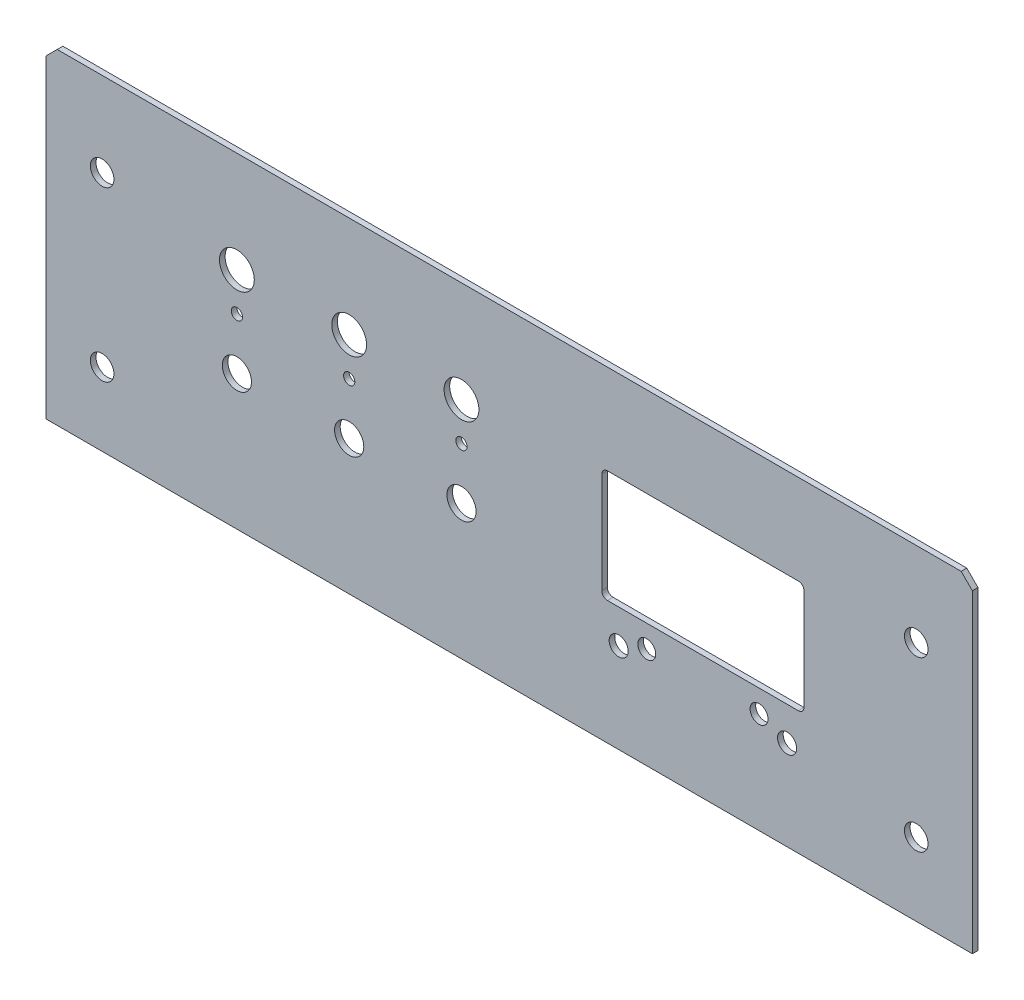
ISO-10303-21;
HEADER;
FILE_DESCRIPTION(('STEP AP214'),'2;1');
FILE_NAME('part.step','',(''),(''),'','','');
FILE_SCHEMA(('AUTOMOTIVE_DESIGN { 1 0 10303 214 1 1 1 1 }'));
ENDSEC;
DATA;
#1=APPLICATION_CONTEXT('core data for automotive mechanical design processes');
#2=APPLICATION_PROTOCOL_DEFINITION('international standard','automotive_design',2000,#1);
#3=PRODUCT_CONTEXT('',#1,'mechanical');
#4=PRODUCT('Part','Part','',(#3));
#5=PRODUCT_RELATED_PRODUCT_CATEGORY('part','',(#4));
#6=PRODUCT_DEFINITION_FORMATION('','',#4);
#7=PRODUCT_DEFINITION_CONTEXT('part definition',#1,'design');
#8=PRODUCT_DEFINITION('design','',#6,#7);
#9=PRODUCT_DEFINITION_SHAPE('','',#8);
#10=(LENGTH_UNIT() NAMED_UNIT(*) SI_UNIT(.MILLI.,.METRE.));
#11=(NAMED_UNIT(*) PLANE_ANGLE_UNIT() SI_UNIT($,.RADIAN.));
#12=(NAMED_UNIT(*) SI_UNIT($,.STERADIAN.) SOLID_ANGLE_UNIT());
#13=UNCERTAINTY_MEASURE_WITH_UNIT(LENGTH_MEASURE(1.E-05),#10,'distance_accuracy_value','');
#14=(GEOMETRIC_REPRESENTATION_CONTEXT(3) GLOBAL_UNCERTAINTY_ASSIGNED_CONTEXT((#13)) GLOBAL_UNIT_ASSIGNED_CONTEXT((#10,
#11,#12)) REPRESENTATION_CONTEXT('',''));
#15=CARTESIAN_POINT('',(0.,0.,0.));
#16=DIRECTION('',(0.,0.,1.));
#17=DIRECTION('',(1.,0.,0.));
#18=AXIS2_PLACEMENT_3D('',#15,#16,#17);
#19=CARTESIAN_POINT('',(82.5,27.,-1.));
#20=DIRECTION('',(1.,0.,0.));
#21=DIRECTION('',(0.,1.,0.));
#22=AXIS2_PLACEMENT_3D('',#19,#20,#21);
#23=PLANE('',#22);
#24=DIRECTION('',(0.,1.,0.));
#25=VECTOR('',#24,1.);
#26=CARTESIAN_POINT('',(82.5,27.,0.));
#27=LINE('',#26,#25);
#28=CARTESIAN_POINT('',(82.5,-29.,0.));
#29=VERTEX_POINT('',#28);
#30=CARTESIAN_POINT('',(82.5,27.,0.));
#31=VERTEX_POINT('',#30);
#32=EDGE_CURVE('E274',#29,#31,#27,.T.);
#33=ORIENTED_EDGE('',*,*,#32,.F.);
#34=DIRECTION('',(0.,0.,1.));
#35=VECTOR('',#34,1.);
#36=CARTESIAN_POINT('',(82.5,-29.,-1.));
#37=LINE('',#36,#35);
#38=CARTESIAN_POINT('',(82.5,-29.,-1.));
#39=VERTEX_POINT('',#38);
#40=EDGE_CURVE('E11',#39,#29,#37,.T.);
#41=ORIENTED_EDGE('',*,*,#40,.F.);
#42=DIRECTION('',(0.,1.,0.));
#43=VECTOR('',#42,1.);
#44=CARTESIAN_POINT('',(82.5,27.,-1.));
#45=LINE('',#44,#43);
#46=CARTESIAN_POINT('',(82.5,27.,-1.));
#47=VERTEX_POINT('',#46);
#48=EDGE_CURVE('E277',#39,#47,#45,.T.);
#49=ORIENTED_EDGE('',*,*,#48,.T.);
#50=DIRECTION('',(0.,0.,1.));
#51=VECTOR('',#50,1.);
#52=CARTESIAN_POINT('',(82.5,27.,-1.));
#53=LINE('',#52,#51);
#54=EDGE_CURVE('E41',#47,#31,#53,.T.);
#55=ORIENTED_EDGE('',*,*,#54,.T.);
#56=EDGE_LOOP('',(#33,#41,#49,#55));
#57=FACE_BOUND('',#56,.T.);
#58=ADVANCED_FACE('F38',(#57),#23,.T.);
#59=CARTESIAN_POINT('',(-82.5,-29.,-1.));
#60=DIRECTION('',(0.,-1.,0.));
#61=DIRECTION('',(0.,0.,-1.));
#62=AXIS2_PLACEMENT_3D('',#59,#60,#61);
#63=PLANE('',#62);
#64=DIRECTION('',(1.,0.,0.));
#65=VECTOR('',#64,1.);
#66=CARTESIAN_POINT('',(-82.5,-29.,0.));
#67=LINE('',#66,#65);
#68=CARTESIAN_POINT('',(-82.5,-29.,0.));
#69=VERTEX_POINT('',#68);
#70=EDGE_CURVE('E281',#69,#29,#67,.T.);
#71=ORIENTED_EDGE('',*,*,#70,.F.);
#72=DIRECTION('',(0.,0.,1.));
#73=VECTOR('',#72,1.);
#74=CARTESIAN_POINT('',(-82.5,-29.,-1.));
#75=LINE('',#74,#73);
#76=CARTESIAN_POINT('',(-82.5,-29.,-1.));
#77=VERTEX_POINT('',#76);
#78=EDGE_CURVE('E46',#77,#69,#75,.T.);
#79=ORIENTED_EDGE('',*,*,#78,.F.);
#80=DIRECTION('',(1.,0.,0.));
#81=VECTOR('',#80,1.);
#82=CARTESIAN_POINT('',(-82.5,-29.,-1.));
#83=LINE('',#82,#81);
#84=EDGE_CURVE('E293',#77,#39,#83,.T.);
#85=ORIENTED_EDGE('',*,*,#84,.T.);
#86=ORIENTED_EDGE('',*,*,#40,.T.);
#87=EDGE_LOOP('',(#71,#79,#85,#86));
#88=FACE_BOUND('',#87,.T.);
#89=ADVANCED_FACE('F330',(#88),#63,.T.);
#90=CARTESIAN_POINT('',(-82.5,27.,-1.));
#91=DIRECTION('',(-1.,0.,0.));
#92=DIRECTION('',(0.,0.,1.));
#93=AXIS2_PLACEMENT_3D('',#90,#91,#92);
#94=PLANE('',#93);
#95=DIRECTION('',(0.,-1.,0.));
#96=VECTOR('',#95,1.);
#97=CARTESIAN_POINT('',(-82.5,27.,0.));
#98=LINE('',#97,#96);
#99=CARTESIAN_POINT('',(-82.5,27.,0.));
#100=VERTEX_POINT('',#99);
#101=EDGE_CURVE('E307',#100,#69,#98,.T.);
#102=ORIENTED_EDGE('',*,*,#101,.F.);
#103=DIRECTION('',(0.,0.,1.));
#104=VECTOR('',#103,1.);
#105=CARTESIAN_POINT('',(-82.5,27.,-1.));
#106=LINE('',#105,#104);
#107=CARTESIAN_POINT('',(-82.5,27.,-1.));
#108=VERTEX_POINT('',#107);
#109=EDGE_CURVE('E313',#108,#100,#106,.T.);
#110=ORIENTED_EDGE('',*,*,#109,.F.);
#111=DIRECTION('',(0.,-1.,0.));
#112=VECTOR('',#111,1.);
#113=CARTESIAN_POINT('',(-82.5,27.,-1.));
#114=LINE('',#113,#112);
#115=EDGE_CURVE('E290',#108,#77,#114,.T.);
#116=ORIENTED_EDGE('',*,*,#115,.T.);
#117=ORIENTED_EDGE('',*,*,#78,.T.);
#118=EDGE_LOOP('',(#102,#110,#116,#117));
#119=FACE_BOUND('',#118,.T.);
#120=ADVANCED_FACE('F342',(#119),#94,.T.);
#121=CARTESIAN_POINT('',(-80.5,29.,-1.));
#122=DIRECTION('',(-0.707106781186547,0.707106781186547,0.));
#123=DIRECTION('',(-0.707106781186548,-0.707106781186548,0.));
#124=AXIS2_PLACEMENT_3D('',#121,#122,#123);
#125=PLANE('',#124);
#126=DIRECTION('',(-0.707106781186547,-0.707106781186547,0.));
#127=VECTOR('',#126,1.);
#128=CARTESIAN_POINT('',(-80.5,29.,0.));
#129=LINE('',#128,#127);
#130=CARTESIAN_POINT('',(-80.5,29.,0.));
#131=VERTEX_POINT('',#130);
#132=EDGE_CURVE('E304',#131,#100,#129,.T.);
#133=ORIENTED_EDGE('',*,*,#132,.F.);
#134=DIRECTION('',(0.,0.,1.));
#135=VECTOR('',#134,1.);
#136=CARTESIAN_POINT('',(-80.5,29.,-1.));
#137=LINE('',#136,#135);
#138=CARTESIAN_POINT('',(-80.5,29.,-1.));
#139=VERTEX_POINT('',#138);
#140=EDGE_CURVE('E315',#139,#131,#137,.T.);
#141=ORIENTED_EDGE('',*,*,#140,.F.);
#142=DIRECTION('',(-0.707106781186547,-0.707106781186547,0.));
#143=VECTOR('',#142,1.);
#144=CARTESIAN_POINT('',(-80.5,29.,-1.));
#145=LINE('',#144,#143);
#146=EDGE_CURVE('E287',#139,#108,#145,.T.);
#147=ORIENTED_EDGE('',*,*,#146,.T.);
#148=ORIENTED_EDGE('',*,*,#109,.T.);
#149=EDGE_LOOP('',(#133,#141,#147,#148));
#150=FACE_BOUND('',#149,.T.);
#151=ADVANCED_FACE('F340',(#150),#125,.T.);
#152=CARTESIAN_POINT('',(-80.5,29.,-1.));
#153=DIRECTION('',(0.,1.,0.));
#154=DIRECTION('',(0.,0.,1.));
#155=AXIS2_PLACEMENT_3D('',#152,#153,#154);
#156=PLANE('',#155);
#157=DIRECTION('',(-1.,0.,0.));
#158=VECTOR('',#157,1.);
#159=CARTESIAN_POINT('',(-80.5,29.,0.));
#160=LINE('',#159,#158);
#161=CARTESIAN_POINT('',(80.5,29.,0.));
#162=VERTEX_POINT('',#161);
#163=EDGE_CURVE('E301',#162,#131,#160,.T.);
#164=ORIENTED_EDGE('',*,*,#163,.F.);
#165=DIRECTION('',(0.,0.,1.));
#166=VECTOR('',#165,1.);
#167=CARTESIAN_POINT('',(80.5,29.,-1.));
#168=LINE('',#167,#166);
#169=CARTESIAN_POINT('',(80.5,29.,-1.));
#170=VERTEX_POINT('',#169);
#171=EDGE_CURVE('E316',#170,#162,#168,.T.);
#172=ORIENTED_EDGE('',*,*,#171,.F.);
#173=DIRECTION('',(-1.,0.,0.));
#174=VECTOR('',#173,1.);
#175=CARTESIAN_POINT('',(-80.5,29.,-1.));
#176=LINE('',#175,#174);
#177=EDGE_CURVE('E284',#170,#139,#176,.T.);
#178=ORIENTED_EDGE('',*,*,#177,.T.);
#179=ORIENTED_EDGE('',*,*,#140,.T.);
#180=EDGE_LOOP('',(#164,#172,#178,#179));
#181=FACE_BOUND('',#180,.T.);
#182=ADVANCED_FACE('F337',(#181),#156,.T.);
#183=CARTESIAN_POINT('',(80.5,29.,-1.));
#184=DIRECTION('',(0.707106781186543,0.707106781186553,0.));
#185=DIRECTION('',(-0.707106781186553,0.707106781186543,0.));
#186=AXIS2_PLACEMENT_3D('',#183,#184,#185);
#187=PLANE('',#186);
#188=DIRECTION('',(-0.707106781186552,0.707106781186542,0.));
#189=VECTOR('',#188,1.);
#190=CARTESIAN_POINT('',(80.5,29.,0.));
#191=LINE('',#190,#189);
#192=EDGE_CURVE('E298',#31,#162,#191,.T.);
#193=ORIENTED_EDGE('',*,*,#192,.F.);
#194=ORIENTED_EDGE('',*,*,#54,.F.);
#195=DIRECTION('',(-0.707106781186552,0.707106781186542,0.));
#196=VECTOR('',#195,1.);
#197=CARTESIAN_POINT('',(80.5,29.,-1.));
#198=LINE('',#197,#196);
#199=EDGE_CURVE('E280',#47,#170,#198,.T.);
#200=ORIENTED_EDGE('',*,*,#199,.T.);
#201=ORIENTED_EDGE('',*,*,#171,.T.);
#202=EDGE_LOOP('',(#193,#194,#200,#201));
#203=FACE_BOUND('',#202,.T.);
#204=ADVANCED_FACE('F324',(#203),#187,.T.);
#205=CARTESIAN_POINT('',(0.,0.,-1.));
#206=DIRECTION('',(0.,0.,1.));
#207=DIRECTION('',(1.,0.,0.));
#208=AXIS2_PLACEMENT_3D('',#205,#206,#207);
#209=PLANE('',#208);
#210=CARTESIAN_POINT('',(-48.5,4.2,-1.));
#211=DIRECTION('',(0.,0.,1.));
#212=DIRECTION('',(1.,0.,0.));
#213=AXIS2_PLACEMENT_3D('',#210,#211,#212);
#214=CIRCLE('',#213,0.999999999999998);
#215=CARTESIAN_POINT('',(-47.5,4.2,-1.));
#216=VERTEX_POINT('',#215);
#217=EDGE_CURVE('E201',#216,#216,#214,.F.);
#218=ORIENTED_EDGE('',*,*,#217,.F.);
#219=EDGE_LOOP('',(#218));
#220=FACE_BOUND('',#219,.T.);
#221=DIRECTION('',(0.,-1.,0.));
#222=VECTOR('',#221,1.);
#223=CARTESIAN_POINT('',(52.5,12.,-1.));
#224=LINE('',#223,#222);
#225=CARTESIAN_POINT('',(52.5,12.,-1.));
#226=VERTEX_POINT('',#225);
#227=CARTESIAN_POINT('',(52.5,-6.,-1.));
#228=VERTEX_POINT('',#227);
#229=EDGE_CURVE('E160',#226,#228,#224,.T.);
#230=ORIENTED_EDGE('',*,*,#229,.F.);
#231=CARTESIAN_POINT('',(51.5,12.,-1.));
#232=DIRECTION('',(0.,0.,1.));
#233=DIRECTION('',(1.,0.,0.));
#234=AXIS2_PLACEMENT_3D('',#231,#232,#233);
#235=CIRCLE('',#234,1.);
#236=CARTESIAN_POINT('',(51.5,13.,-1.));
#237=VERTEX_POINT('',#236);
#238=EDGE_CURVE('E141',#237,#226,#235,.F.);
#239=ORIENTED_EDGE('',*,*,#238,.F.);
#240=DIRECTION('',(1.,0.,0.));
#241=VECTOR('',#240,1.);
#242=CARTESIAN_POINT('',(17.5,13.,-1.));
#243=LINE('',#242,#241);
#244=CARTESIAN_POINT('',(17.5,13.,-1.));
#245=VERTEX_POINT('',#244);
#246=EDGE_CURVE('E150',#245,#237,#243,.T.);
#247=ORIENTED_EDGE('',*,*,#246,.F.);
#248=CARTESIAN_POINT('',(17.5,12.,-1.));
#249=DIRECTION('',(0.,0.,1.));
#250=DIRECTION('',(1.,0.,0.));
#251=AXIS2_PLACEMENT_3D('',#248,#249,#250);
#252=CIRCLE('',#251,1.);
#253=CARTESIAN_POINT('',(16.5,12.,-1.));
#254=VERTEX_POINT('',#253);
#255=EDGE_CURVE('E54',#254,#245,#252,.F.);
#256=ORIENTED_EDGE('',*,*,#255,.F.);
#257=DIRECTION('',(0.,1.,0.));
#258=VECTOR('',#257,1.);
#259=CARTESIAN_POINT('',(16.5,12.,-1.));
#260=LINE('',#259,#258);
#261=CARTESIAN_POINT('',(16.5,-6.,-1.));
#262=VERTEX_POINT('',#261);
#263=EDGE_CURVE('E809',#262,#254,#260,.T.);
#264=ORIENTED_EDGE('',*,*,#263,.F.);
#265=CARTESIAN_POINT('',(17.5,-6.,-1.));
#266=DIRECTION('',(0.,0.,1.));
#267=DIRECTION('',(1.,0.,0.));
#268=AXIS2_PLACEMENT_3D('',#265,#266,#267);
#269=CIRCLE('',#268,1.);
#270=CARTESIAN_POINT('',(17.5,-7.,-1.));
#271=VERTEX_POINT('',#270);
#272=EDGE_CURVE('E812',#271,#262,#269,.F.);
#273=ORIENTED_EDGE('',*,*,#272,.F.);
#274=DIRECTION('',(-1.,0.,0.));
#275=VECTOR('',#274,1.);
#276=CARTESIAN_POINT('',(17.5,-7.,-1.));
#277=LINE('',#276,#275);
#278=CARTESIAN_POINT('',(51.5,-7.,-1.));
#279=VERTEX_POINT('',#278);
#280=EDGE_CURVE('E815',#279,#271,#277,.T.);
#281=ORIENTED_EDGE('',*,*,#280,.F.);
#282=CARTESIAN_POINT('',(51.5,-6.,-1.));
#283=DIRECTION('',(0.,0.,1.));
#284=DIRECTION('',(1.,0.,0.));
#285=AXIS2_PLACEMENT_3D('',#282,#283,#284);
#286=CIRCLE('',#285,0.999999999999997);
#287=EDGE_CURVE('E164',#228,#279,#286,.F.);
#288=ORIENTED_EDGE('',*,*,#287,.F.);
#289=EDGE_LOOP('',(#230,#239,#247,#256,#264,#273,#281,#288));
#290=FACE_BOUND('',#289,.T.);
#291=CARTESIAN_POINT('',(-28.5,4.2,-1.));
#292=DIRECTION('',(0.,0.,1.));
#293=DIRECTION('',(1.,0.,0.));
#294=AXIS2_PLACEMENT_3D('',#291,#292,#293);
#295=CIRCLE('',#294,0.999999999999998);
#296=CARTESIAN_POINT('',(-27.5,4.2,-1.));
#297=VERTEX_POINT('',#296);
#298=EDGE_CURVE('E207',#297,#297,#295,.F.);
#299=ORIENTED_EDGE('',*,*,#298,.F.);
#300=EDGE_LOOP('',(#299));
#301=FACE_BOUND('',#300,.T.);
#302=CARTESIAN_POINT('',(-8.49999999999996,4.2,-1.));
#303=DIRECTION('',(0.,0.,1.));
#304=DIRECTION('',(1.,0.,0.));
#305=AXIS2_PLACEMENT_3D('',#302,#303,#304);
#306=CIRCLE('',#305,0.999999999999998);
#307=CARTESIAN_POINT('',(-7.49999999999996,4.2,-1.));
#308=VERTEX_POINT('',#307);
#309=EDGE_CURVE('E803',#308,#308,#306,.F.);
#310=ORIENTED_EDGE('',*,*,#309,.F.);
#311=EDGE_LOOP('',(#310));
#312=FACE_BOUND('',#311,.T.);
#313=CARTESIAN_POINT('',(-8.49999999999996,-5.,-1.));
#314=DIRECTION('',(0.,0.,1.));
#315=DIRECTION('',(1.,0.,0.));
#316=AXIS2_PLACEMENT_3D('',#313,#314,#315);
#317=CIRCLE('',#316,2.6);
#318=CARTESIAN_POINT('',(-5.89999999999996,-5.,-1.));
#319=VERTEX_POINT('',#318);
#320=EDGE_CURVE('E806',#319,#319,#317,.F.);
#321=ORIENTED_EDGE('',*,*,#320,.F.);
#322=EDGE_LOOP('',(#321));
#323=FACE_BOUND('',#322,.T.);
#324=CARTESIAN_POINT('',(-8.49999999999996,11.,-1.));
#325=DIRECTION('',(0.,0.,1.));
#326=DIRECTION('',(1.,0.,0.));
#327=AXIS2_PLACEMENT_3D('',#324,#325,#326);
#328=CIRCLE('',#327,3.1);
#329=CARTESIAN_POINT('',(-5.39999999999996,11.,-1.));
#330=VERTEX_POINT('',#329);
#331=EDGE_CURVE('E796',#330,#330,#328,.F.);
#332=ORIENTED_EDGE('',*,*,#331,.F.);
#333=EDGE_LOOP('',(#332));
#334=FACE_BOUND('',#333,.T.);
#335=CARTESIAN_POINT('',(49.5,-13.,-1.));
#336=DIRECTION('',(0.,0.,1.));
#337=DIRECTION('',(1.,0.,0.));
#338=AXIS2_PLACEMENT_3D('',#335,#336,#337);
#339=CIRCLE('',#338,1.7);
#340=CARTESIAN_POINT('',(51.2,-13.,-1.));
#341=VERTEX_POINT('',#340);
#342=EDGE_CURVE('E202',#341,#341,#339,.F.);
#343=ORIENTED_EDGE('',*,*,#342,.F.);
#344=EDGE_LOOP('',(#343));
#345=FACE_BOUND('',#344,.T.);
#346=CARTESIAN_POINT('',(-48.5,-5.,-1.));
#347=DIRECTION('',(0.,0.,1.));
#348=DIRECTION('',(1.,0.,0.));
#349=AXIS2_PLACEMENT_3D('',#346,#347,#348);
#350=CIRCLE('',#349,2.6);
#351=CARTESIAN_POINT('',(-45.9,-5.,-1.));
#352=VERTEX_POINT('',#351);
#353=EDGE_CURVE('E232',#352,#352,#350,.F.);
#354=ORIENTED_EDGE('',*,*,#353,.F.);
#355=EDGE_LOOP('',(#354));
#356=FACE_BOUND('',#355,.T.);
#357=CARTESIAN_POINT('',(-28.5,11.,-1.));
#358=DIRECTION('',(0.,0.,1.));
#359=DIRECTION('',(1.,0.,0.));
#360=AXIS2_PLACEMENT_3D('',#357,#358,#359);
#361=CIRCLE('',#360,3.1);
#362=CARTESIAN_POINT('',(-25.4,11.,-1.));
#363=VERTEX_POINT('',#362);
#364=EDGE_CURVE('E233',#363,#363,#361,.F.);
#365=ORIENTED_EDGE('',*,*,#364,.F.);
#366=EDGE_LOOP('',(#365));
#367=FACE_BOUND('',#366,.T.);
#368=CARTESIAN_POINT('',(24.5,-11.,-1.));
#369=DIRECTION('',(0.,0.,1.));
#370=DIRECTION('',(1.,0.,0.));
#371=AXIS2_PLACEMENT_3D('',#368,#369,#370);
#372=CIRCLE('',#371,1.6);
#373=CARTESIAN_POINT('',(26.1,-11.,-1.));
#374=VERTEX_POINT('',#373);
#375=EDGE_CURVE('E240',#374,#374,#372,.F.);
#376=ORIENTED_EDGE('',*,*,#375,.F.);
#377=EDGE_LOOP('',(#376));
#378=FACE_BOUND('',#377,.T.);
#379=CARTESIAN_POINT('',(44.5,-11.,-1.));
#380=DIRECTION('',(0.,0.,1.));
#381=DIRECTION('',(1.,0.,0.));
#382=AXIS2_PLACEMENT_3D('',#379,#380,#381);
#383=CIRCLE('',#382,1.6);
#384=CARTESIAN_POINT('',(46.1,-11.,-1.));
#385=VERTEX_POINT('',#384);
#386=EDGE_CURVE('E214',#385,#385,#383,.F.);
#387=ORIENTED_EDGE('',*,*,#386,.F.);
#388=EDGE_LOOP('',(#387));
#389=FACE_BOUND('',#388,.T.);
#390=CARTESIAN_POINT('',(-28.5,-5.,-1.));
#391=DIRECTION('',(0.,0.,1.));
#392=DIRECTION('',(1.,0.,0.));
#393=AXIS2_PLACEMENT_3D('',#390,#391,#392);
#394=CIRCLE('',#393,2.6);
#395=CARTESIAN_POINT('',(-25.9,-5.,-1.));
#396=VERTEX_POINT('',#395);
#397=EDGE_CURVE('E215',#396,#396,#394,.F.);
#398=ORIENTED_EDGE('',*,*,#397,.F.);
#399=EDGE_LOOP('',(#398));
#400=FACE_BOUND('',#399,.T.);
#401=CARTESIAN_POINT('',(19.5,-13.,-1.));
#402=DIRECTION('',(0.,0.,1.));
#403=DIRECTION('',(1.,0.,0.));
#404=AXIS2_PLACEMENT_3D('',#401,#402,#403);
#405=CIRCLE('',#404,1.7);
#406=CARTESIAN_POINT('',(21.2,-13.,-1.));
#407=VERTEX_POINT('',#406);
#408=EDGE_CURVE('E222',#407,#407,#405,.F.);
#409=ORIENTED_EDGE('',*,*,#408,.F.);
#410=EDGE_LOOP('',(#409));
#411=FACE_BOUND('',#410,.T.);
#412=CARTESIAN_POINT('',(-48.5,11.,-1.));
#413=DIRECTION('',(0.,0.,1.));
#414=DIRECTION('',(1.,0.,0.));
#415=AXIS2_PLACEMENT_3D('',#412,#413,#414);
#416=CIRCLE('',#415,3.1);
#417=CARTESIAN_POINT('',(-45.4,11.,-1.));
#418=VERTEX_POINT('',#417);
#419=EDGE_CURVE('E249',#418,#418,#416,.F.);
#420=ORIENTED_EDGE('',*,*,#419,.F.);
#421=EDGE_LOOP('',(#420));
#422=FACE_BOUND('',#421,.T.);
#423=CARTESIAN_POINT('',(-72.5,14.,-1.));
#424=DIRECTION('',(0.,0.,-1.));
#425=DIRECTION('',(-1.,0.,0.));
#426=AXIS2_PLACEMENT_3D('',#423,#424,#425);
#427=CIRCLE('',#426,2.1);
#428=CARTESIAN_POINT('',(-74.6,14.,-1.));
#429=VERTEX_POINT('',#428);
#430=EDGE_CURVE('E260',#429,#429,#427,.T.);
#431=ORIENTED_EDGE('',*,*,#430,.F.);
#432=EDGE_LOOP('',(#431));
#433=FACE_BOUND('',#432,.T.);
#434=CARTESIAN_POINT('',(72.5,-16.,-1.));
#435=DIRECTION('',(0.,0.,-1.));
#436=DIRECTION('',(-1.,0.,0.));
#437=AXIS2_PLACEMENT_3D('',#434,#435,#436);
#438=CIRCLE('',#437,2.1);
#439=CARTESIAN_POINT('',(70.4,-16.,-1.));
#440=VERTEX_POINT('',#439);
#441=EDGE_CURVE('E253',#440,#440,#438,.T.);
#442=ORIENTED_EDGE('',*,*,#441,.F.);
#443=EDGE_LOOP('',(#442));
#444=FACE_BOUND('',#443,.T.);
#445=CARTESIAN_POINT('',(-72.5,-16.,-1.));
#446=DIRECTION('',(0.,0.,-1.));
#447=DIRECTION('',(-1.,0.,0.));
#448=AXIS2_PLACEMENT_3D('',#445,#446,#447);
#449=CIRCLE('',#448,2.1);
#450=CARTESIAN_POINT('',(-74.6,-16.,-1.));
#451=VERTEX_POINT('',#450);
#452=EDGE_CURVE('E265',#451,#451,#449,.T.);
#453=ORIENTED_EDGE('',*,*,#452,.F.);
#454=EDGE_LOOP('',(#453));
#455=FACE_BOUND('',#454,.T.);
#456=CARTESIAN_POINT('',(72.5,14.,-1.));
#457=DIRECTION('',(0.,0.,-1.));
#458=DIRECTION('',(-1.,0.,0.));
#459=AXIS2_PLACEMENT_3D('',#456,#457,#458);
#460=CIRCLE('',#459,2.1);
#461=CARTESIAN_POINT('',(70.4,14.,-1.));
#462=VERTEX_POINT('',#461);
#463=EDGE_CURVE('E271',#462,#462,#460,.T.);
#464=ORIENTED_EDGE('',*,*,#463,.F.);
#465=EDGE_LOOP('',(#464));
#466=FACE_BOUND('',#465,.T.);
#467=ORIENTED_EDGE('',*,*,#48,.F.);
#468=ORIENTED_EDGE('',*,*,#84,.F.);
#469=ORIENTED_EDGE('',*,*,#115,.F.);
#470=ORIENTED_EDGE('',*,*,#146,.F.);
#471=ORIENTED_EDGE('',*,*,#177,.F.);
#472=ORIENTED_EDGE('',*,*,#199,.F.);
#473=EDGE_LOOP('',(#467,#468,#469,#470,#471,#472));
#474=FACE_BOUND('',#473,.T.);
#475=ADVANCED_FACE('F156',(#220,#290,#301,#312,#323,#334,#345,#356,#367,#378,#389,#400,#411,
#422,#433,#444,#455,#466,#474),#209,.F.);
#476=CARTESIAN_POINT('',(0.,0.,0.));
#477=DIRECTION('',(0.,0.,1.));
#478=DIRECTION('',(1.,0.,0.));
#479=AXIS2_PLACEMENT_3D('',#476,#477,#478);
#480=PLANE('',#479);
#481=CARTESIAN_POINT('',(-48.5,4.2,0.));
#482=DIRECTION('',(0.,0.,1.));
#483=DIRECTION('',(1.,0.,0.));
#484=AXIS2_PLACEMENT_3D('',#481,#482,#483);
#485=CIRCLE('',#484,0.999999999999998);
#486=CARTESIAN_POINT('',(-47.5,4.2,0.));
#487=VERTEX_POINT('',#486);
#488=EDGE_CURVE('E198',#487,#487,#485,.T.);
#489=ORIENTED_EDGE('',*,*,#488,.F.);
#490=EDGE_LOOP('',(#489));
#491=FACE_BOUND('',#490,.T.);
#492=CARTESIAN_POINT('',(51.5,12.,0.));
#493=DIRECTION('',(0.,0.,1.));
#494=DIRECTION('',(-1.,0.,0.));
#495=AXIS2_PLACEMENT_3D('',#492,#493,#494);
#496=CIRCLE('',#495,1.);
#497=CARTESIAN_POINT('',(52.5,12.,0.));
#498=VERTEX_POINT('',#497);
#499=CARTESIAN_POINT('',(51.5,13.,0.));
#500=VERTEX_POINT('',#499);
#501=EDGE_CURVE('E62',#498,#500,#496,.T.);
#502=ORIENTED_EDGE('',*,*,#501,.F.);
#503=DIRECTION('',(0.,1.,0.));
#504=VECTOR('',#503,1.);
#505=CARTESIAN_POINT('',(52.5,12.,0.));
#506=LINE('',#505,#504);
#507=CARTESIAN_POINT('',(52.5,-6.,0.));
#508=VERTEX_POINT('',#507);
#509=EDGE_CURVE('E147',#508,#498,#506,.T.);
#510=ORIENTED_EDGE('',*,*,#509,.F.);
#511=CARTESIAN_POINT('',(51.5,-6.,0.));
#512=DIRECTION('',(0.,0.,1.));
#513=DIRECTION('',(-1.,0.,0.));
#514=AXIS2_PLACEMENT_3D('',#511,#512,#513);
#515=CIRCLE('',#514,0.999999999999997);
#516=CARTESIAN_POINT('',(51.5,-7.,0.));
#517=VERTEX_POINT('',#516);
#518=EDGE_CURVE('E181',#517,#508,#515,.T.);
#519=ORIENTED_EDGE('',*,*,#518,.F.);
#520=DIRECTION('',(1.,0.,0.));
#521=VECTOR('',#520,1.);
#522=CARTESIAN_POINT('',(17.5,-7.,0.));
#523=LINE('',#522,#521);
#524=CARTESIAN_POINT('',(17.5,-7.,0.));
#525=VERTEX_POINT('',#524);
#526=EDGE_CURVE('E178',#525,#517,#523,.T.);
#527=ORIENTED_EDGE('',*,*,#526,.F.);
#528=CARTESIAN_POINT('',(17.5,-6.,0.));
#529=DIRECTION('',(0.,0.,1.));
#530=DIRECTION('',(-1.,0.,0.));
#531=AXIS2_PLACEMENT_3D('',#528,#529,#530);
#532=CIRCLE('',#531,1.);
#533=CARTESIAN_POINT('',(16.5,-6.,0.));
#534=VERTEX_POINT('',#533);
#535=EDGE_CURVE('E175',#534,#525,#532,.T.);
#536=ORIENTED_EDGE('',*,*,#535,.F.);
#537=DIRECTION('',(0.,-1.,0.));
#538=VECTOR('',#537,1.);
#539=CARTESIAN_POINT('',(16.5,12.,0.));
#540=LINE('',#539,#538);
#541=CARTESIAN_POINT('',(16.5,12.,0.));
#542=VERTEX_POINT('',#541);
#543=EDGE_CURVE('E172',#542,#534,#540,.T.);
#544=ORIENTED_EDGE('',*,*,#543,.F.);
#545=CARTESIAN_POINT('',(17.5,12.,0.));
#546=DIRECTION('',(0.,0.,1.));
#547=DIRECTION('',(-1.,0.,0.));
#548=AXIS2_PLACEMENT_3D('',#545,#546,#547);
#549=CIRCLE('',#548,1.);
#550=CARTESIAN_POINT('',(17.5,13.,0.));
#551=VERTEX_POINT('',#550);
#552=EDGE_CURVE('E169',#551,#542,#549,.T.);
#553=ORIENTED_EDGE('',*,*,#552,.F.);
#554=DIRECTION('',(-1.,0.,0.));
#555=VECTOR('',#554,1.);
#556=CARTESIAN_POINT('',(17.5,13.,0.));
#557=LINE('',#556,#555);
#558=EDGE_CURVE('E162',#500,#551,#557,.T.);
#559=ORIENTED_EDGE('',*,*,#558,.F.);
#560=EDGE_LOOP('',(#502,#510,#519,#527,#536,#544,#553,#559));
#561=FACE_BOUND('',#560,.T.);
#562=CARTESIAN_POINT('',(-28.5,4.2,0.));
#563=DIRECTION('',(0.,0.,1.));
#564=DIRECTION('',(1.,0.,0.));
#565=AXIS2_PLACEMENT_3D('',#562,#563,#564);
#566=CIRCLE('',#565,0.999999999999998);
#567=CARTESIAN_POINT('',(-27.5,4.2,0.));
#568=VERTEX_POINT('',#567);
#569=EDGE_CURVE('E153',#568,#568,#566,.T.);
#570=ORIENTED_EDGE('',*,*,#569,.F.);
#571=EDGE_LOOP('',(#570));
#572=FACE_BOUND('',#571,.T.);
#573=CARTESIAN_POINT('',(-8.49999999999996,4.2,0.));
#574=DIRECTION('',(0.,0.,1.));
#575=DIRECTION('',(1.,0.,0.));
#576=AXIS2_PLACEMENT_3D('',#573,#574,#575);
#577=CIRCLE('',#576,0.999999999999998);
#578=CARTESIAN_POINT('',(-7.49999999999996,4.2,0.));
#579=VERTEX_POINT('',#578);
#580=EDGE_CURVE('E729',#579,#579,#577,.T.);
#581=ORIENTED_EDGE('',*,*,#580,.F.);
#582=EDGE_LOOP('',(#581));
#583=FACE_BOUND('',#582,.T.);
#584=CARTESIAN_POINT('',(-8.49999999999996,-5.,0.));
#585=DIRECTION('',(0.,0.,1.));
#586=DIRECTION('',(1.,0.,0.));
#587=AXIS2_PLACEMENT_3D('',#584,#585,#586);
#588=CIRCLE('',#587,2.6);
#589=CARTESIAN_POINT('',(-5.89999999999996,-5.,0.));
#590=VERTEX_POINT('',#589);
#591=EDGE_CURVE('E733',#590,#590,#588,.T.);
#592=ORIENTED_EDGE('',*,*,#591,.F.);
#593=EDGE_LOOP('',(#592));
#594=FACE_BOUND('',#593,.T.);
#595=CARTESIAN_POINT('',(-8.49999999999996,11.,0.));
#596=DIRECTION('',(0.,0.,1.));
#597=DIRECTION('',(1.,0.,0.));
#598=AXIS2_PLACEMENT_3D('',#595,#596,#597);
#599=CIRCLE('',#598,3.1);
#600=CARTESIAN_POINT('',(-5.39999999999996,11.,0.));
#601=VERTEX_POINT('',#600);
#602=EDGE_CURVE('E737',#601,#601,#599,.T.);
#603=ORIENTED_EDGE('',*,*,#602,.F.);
#604=EDGE_LOOP('',(#603));
#605=FACE_BOUND('',#604,.T.);
#606=CARTESIAN_POINT('',(49.5,-13.,0.));
#607=DIRECTION('',(0.,0.,1.));
#608=DIRECTION('',(1.,0.,0.));
#609=AXIS2_PLACEMENT_3D('',#606,#607,#608);
#610=CIRCLE('',#609,1.7);
#611=CARTESIAN_POINT('',(51.2,-13.,0.));
#612=VERTEX_POINT('',#611);
#613=EDGE_CURVE('E741',#612,#612,#610,.T.);
#614=ORIENTED_EDGE('',*,*,#613,.F.);
#615=EDGE_LOOP('',(#614));
#616=FACE_BOUND('',#615,.T.);
#617=CARTESIAN_POINT('',(-48.5,-5.,0.));
#618=DIRECTION('',(0.,0.,1.));
#619=DIRECTION('',(1.,0.,0.));
#620=AXIS2_PLACEMENT_3D('',#617,#618,#619);
#621=CIRCLE('',#620,2.6);
#622=CARTESIAN_POINT('',(-45.9,-5.,0.));
#623=VERTEX_POINT('',#622);
#624=EDGE_CURVE('E229',#623,#623,#621,.T.);
#625=ORIENTED_EDGE('',*,*,#624,.F.);
#626=EDGE_LOOP('',(#625));
#627=FACE_BOUND('',#626,.T.);
#628=CARTESIAN_POINT('',(-28.5,11.,0.));
#629=DIRECTION('',(0.,0.,1.));
#630=DIRECTION('',(1.,0.,0.));
#631=AXIS2_PLACEMENT_3D('',#628,#629,#630);
#632=CIRCLE('',#631,3.1);
#633=CARTESIAN_POINT('',(-25.4,11.,0.));
#634=VERTEX_POINT('',#633);
#635=EDGE_CURVE('E237',#634,#634,#632,.T.);
#636=ORIENTED_EDGE('',*,*,#635,.F.);
#637=EDGE_LOOP('',(#636));
#638=FACE_BOUND('',#637,.T.);
#639=CARTESIAN_POINT('',(24.5,-11.,0.));
#640=DIRECTION('',(0.,0.,1.));
#641=DIRECTION('',(1.,0.,0.));
#642=AXIS2_PLACEMENT_3D('',#639,#640,#641);
#643=CIRCLE('',#642,1.6);
#644=CARTESIAN_POINT('',(26.1,-11.,0.));
#645=VERTEX_POINT('',#644);
#646=EDGE_CURVE('E218',#645,#645,#643,.T.);
#647=ORIENTED_EDGE('',*,*,#646,.F.);
#648=EDGE_LOOP('',(#647));
#649=FACE_BOUND('',#648,.T.);
#650=CARTESIAN_POINT('',(44.5,-11.,0.));
#651=DIRECTION('',(0.,0.,1.));
#652=DIRECTION('',(1.,0.,0.));
#653=AXIS2_PLACEMENT_3D('',#650,#651,#652);
#654=CIRCLE('',#653,1.6);
#655=CARTESIAN_POINT('',(46.1,-11.,0.));
#656=VERTEX_POINT('',#655);
#657=EDGE_CURVE('E211',#656,#656,#654,.T.);
#658=ORIENTED_EDGE('',*,*,#657,.F.);
#659=EDGE_LOOP('',(#658));
#660=FACE_BOUND('',#659,.T.);
#661=CARTESIAN_POINT('',(-28.5,-5.,0.));
#662=DIRECTION('',(0.,0.,1.));
#663=DIRECTION('',(1.,0.,0.));
#664=AXIS2_PLACEMENT_3D('',#661,#662,#663);
#665=CIRCLE('',#664,2.6);
#666=CARTESIAN_POINT('',(-25.9,-5.,0.));
#667=VERTEX_POINT('',#666);
#668=EDGE_CURVE('E219',#667,#667,#665,.T.);
#669=ORIENTED_EDGE('',*,*,#668,.F.);
#670=EDGE_LOOP('',(#669));
#671=FACE_BOUND('',#670,.T.);
#672=CARTESIAN_POINT('',(19.5,-13.,0.));
#673=DIRECTION('',(0.,0.,1.));
#674=DIRECTION('',(1.,0.,0.));
#675=AXIS2_PLACEMENT_3D('',#672,#673,#674);
#676=CIRCLE('',#675,1.7);
#677=CARTESIAN_POINT('',(21.2,-13.,0.));
#678=VERTEX_POINT('',#677);
#679=EDGE_CURVE('E210',#678,#678,#676,.T.);
#680=ORIENTED_EDGE('',*,*,#679,.F.);
#681=EDGE_LOOP('',(#680));
#682=FACE_BOUND('',#681,.T.);
#683=CARTESIAN_POINT('',(-48.5,11.,0.));
#684=DIRECTION('',(0.,0.,1.));
#685=DIRECTION('',(1.,0.,0.));
#686=AXIS2_PLACEMENT_3D('',#683,#684,#685);
#687=CIRCLE('',#686,3.1);
#688=CARTESIAN_POINT('',(-45.4,11.,0.));
#689=VERTEX_POINT('',#688);
#690=EDGE_CURVE('E236',#689,#689,#687,.T.);
#691=ORIENTED_EDGE('',*,*,#690,.F.);
#692=EDGE_LOOP('',(#691));
#693=FACE_BOUND('',#692,.T.);
#694=CARTESIAN_POINT('',(-72.5,14.,0.));
#695=DIRECTION('',(0.,0.,1.));
#696=DIRECTION('',(1.,0.,0.));
#697=AXIS2_PLACEMENT_3D('',#694,#695,#696);
#698=CIRCLE('',#697,2.1);
#699=CARTESIAN_POINT('',(-70.4,14.,0.));
#700=VERTEX_POINT('',#699);
#701=EDGE_CURVE('E252',#700,#700,#698,.F.);
#702=ORIENTED_EDGE('',*,*,#701,.T.);
#703=EDGE_LOOP('',(#702));
#704=FACE_BOUND('',#703,.T.);
#705=CARTESIAN_POINT('',(72.5,-16.,0.));
#706=DIRECTION('',(0.,0.,1.));
#707=DIRECTION('',(1.,0.,0.));
#708=AXIS2_PLACEMENT_3D('',#705,#706,#707);
#709=CIRCLE('',#708,2.1);
#710=CARTESIAN_POINT('',(74.6,-16.,0.));
#711=VERTEX_POINT('',#710);
#712=EDGE_CURVE('E257',#711,#711,#709,.F.);
#713=ORIENTED_EDGE('',*,*,#712,.T.);
#714=EDGE_LOOP('',(#713));
#715=FACE_BOUND('',#714,.T.);
#716=CARTESIAN_POINT('',(-72.5,-16.,0.));
#717=DIRECTION('',(0.,0.,1.));
#718=DIRECTION('',(1.,0.,0.));
#719=AXIS2_PLACEMENT_3D('',#716,#717,#718);
#720=CIRCLE('',#719,2.1);
#721=CARTESIAN_POINT('',(-70.4,-16.,0.));
#722=VERTEX_POINT('',#721);
#723=EDGE_CURVE('E256',#722,#722,#720,.F.);
#724=ORIENTED_EDGE('',*,*,#723,.T.);
#725=EDGE_LOOP('',(#724));
#726=FACE_BOUND('',#725,.T.);
#727=CARTESIAN_POINT('',(72.5,14.,0.));
#728=DIRECTION('',(0.,0.,1.));
#729=DIRECTION('',(1.,0.,0.));
#730=AXIS2_PLACEMENT_3D('',#727,#728,#729);
#731=CIRCLE('',#730,2.1);
#732=CARTESIAN_POINT('',(74.6,14.,0.));
#733=VERTEX_POINT('',#732);
#734=EDGE_CURVE('E268',#733,#733,#731,.F.);
#735=ORIENTED_EDGE('',*,*,#734,.T.);
#736=EDGE_LOOP('',(#735));
#737=FACE_BOUND('',#736,.T.);
#738=ORIENTED_EDGE('',*,*,#32,.T.);
#739=ORIENTED_EDGE('',*,*,#192,.T.);
#740=ORIENTED_EDGE('',*,*,#163,.T.);
#741=ORIENTED_EDGE('',*,*,#132,.T.);
#742=ORIENTED_EDGE('',*,*,#101,.T.);
#743=ORIENTED_EDGE('',*,*,#70,.T.);
#744=EDGE_LOOP('',(#738,#739,#740,#741,#742,#743));
#745=FACE_BOUND('',#744,.T.);
#746=ADVANCED_FACE('F326',(#491,#561,#572,#583,#594,#605,#616,#627,#638,#649,#660,#671,#682,
#693,#704,#715,#726,#737,#745),#480,.T.);
#747=CARTESIAN_POINT('',(72.5,14.,0.000999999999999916));
#748=DIRECTION('',(0.,0.,-1.));
#749=DIRECTION('',(-1.,0.,0.));
#750=AXIS2_PLACEMENT_3D('',#747,#748,#749);
#751=CYLINDRICAL_SURFACE('',#750,2.1);
#752=ORIENTED_EDGE('',*,*,#734,.F.);
#753=EDGE_LOOP('',(#752));
#754=FACE_BOUND('',#753,.T.);
#755=ORIENTED_EDGE('',*,*,#463,.T.);
#756=EDGE_LOOP('',(#755));
#757=FACE_BOUND('',#756,.T.);
#758=ADVANCED_FACE('F395',(#754,#757),#751,.F.);
#759=CARTESIAN_POINT('',(-72.5,-16.,0.000999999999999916));
#760=DIRECTION('',(0.,0.,-1.));
#761=DIRECTION('',(-1.,0.,0.));
#762=AXIS2_PLACEMENT_3D('',#759,#760,#761);
#763=CYLINDRICAL_SURFACE('',#762,2.1);
#764=ORIENTED_EDGE('',*,*,#723,.F.);
#765=EDGE_LOOP('',(#764));
#766=FACE_BOUND('',#765,.T.);
#767=ORIENTED_EDGE('',*,*,#452,.T.);
#768=EDGE_LOOP('',(#767));
#769=FACE_BOUND('',#768,.T.);
#770=ADVANCED_FACE('F400',(#766,#769),#763,.F.);
#771=CARTESIAN_POINT('',(72.5,-16.,0.000999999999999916));
#772=DIRECTION('',(0.,0.,-1.));
#773=DIRECTION('',(-1.,0.,0.));
#774=AXIS2_PLACEMENT_3D('',#771,#772,#773);
#775=CYLINDRICAL_SURFACE('',#774,2.1);
#776=ORIENTED_EDGE('',*,*,#712,.F.);
#777=EDGE_LOOP('',(#776));
#778=FACE_BOUND('',#777,.T.);
#779=ORIENTED_EDGE('',*,*,#441,.T.);
#780=EDGE_LOOP('',(#779));
#781=FACE_BOUND('',#780,.T.);
#782=ADVANCED_FACE('F413',(#778,#781),#775,.F.);
#783=CARTESIAN_POINT('',(-72.5,14.,0.000999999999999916));
#784=DIRECTION('',(0.,0.,-1.));
#785=DIRECTION('',(-1.,0.,0.));
#786=AXIS2_PLACEMENT_3D('',#783,#784,#785);
#787=CYLINDRICAL_SURFACE('',#786,2.1);
#788=ORIENTED_EDGE('',*,*,#701,.F.);
#789=EDGE_LOOP('',(#788));
#790=FACE_BOUND('',#789,.T.);
#791=ORIENTED_EDGE('',*,*,#430,.T.);
#792=EDGE_LOOP('',(#791));
#793=FACE_BOUND('',#792,.T.);
#794=ADVANCED_FACE('F424',(#790,#793),#787,.F.);
#795=CARTESIAN_POINT('',(-48.5,11.,-1.001));
#796=DIRECTION('',(0.,0.,1.));
#797=DIRECTION('',(1.,0.,0.));
#798=AXIS2_PLACEMENT_3D('',#795,#796,#797);
#799=CYLINDRICAL_SURFACE('',#798,3.1);
#800=ORIENTED_EDGE('',*,*,#690,.T.);
#801=EDGE_LOOP('',(#800));
#802=FACE_BOUND('',#801,.T.);
#803=ORIENTED_EDGE('',*,*,#419,.T.);
#804=EDGE_LOOP('',(#803));
#805=FACE_BOUND('',#804,.T.);
#806=ADVANCED_FACE('F435',(#802,#805),#799,.F.);
#807=CARTESIAN_POINT('',(19.5,-13.,-1.001));
#808=DIRECTION('',(0.,0.,1.));
#809=DIRECTION('',(1.,0.,0.));
#810=AXIS2_PLACEMENT_3D('',#807,#808,#809);
#811=CYLINDRICAL_SURFACE('',#810,1.7);
#812=ORIENTED_EDGE('',*,*,#679,.T.);
#813=EDGE_LOOP('',(#812));
#814=FACE_BOUND('',#813,.T.);
#815=ORIENTED_EDGE('',*,*,#408,.T.);
#816=EDGE_LOOP('',(#815));
#817=FACE_BOUND('',#816,.T.);
#818=ADVANCED_FACE('F462',(#814,#817),#811,.F.);
#819=CARTESIAN_POINT('',(-28.5,-5.,-1.001));
#820=DIRECTION('',(0.,0.,1.));
#821=DIRECTION('',(1.,0.,0.));
#822=AXIS2_PLACEMENT_3D('',#819,#820,#821);
#823=CYLINDRICAL_SURFACE('',#822,2.6);
#824=ORIENTED_EDGE('',*,*,#668,.T.);
#825=EDGE_LOOP('',(#824));
#826=FACE_BOUND('',#825,.T.);
#827=ORIENTED_EDGE('',*,*,#397,.T.);
#828=EDGE_LOOP('',(#827));
#829=FACE_BOUND('',#828,.T.);
#830=ADVANCED_FACE('F473',(#826,#829),#823,.F.);
#831=CARTESIAN_POINT('',(44.5,-11.,-1.001));
#832=DIRECTION('',(0.,0.,1.));
#833=DIRECTION('',(1.,0.,0.));
#834=AXIS2_PLACEMENT_3D('',#831,#832,#833);
#835=CYLINDRICAL_SURFACE('',#834,1.6);
#836=ORIENTED_EDGE('',*,*,#657,.T.);
#837=EDGE_LOOP('',(#836));
#838=FACE_BOUND('',#837,.T.);
#839=ORIENTED_EDGE('',*,*,#386,.T.);
#840=EDGE_LOOP('',(#839));
#841=FACE_BOUND('',#840,.T.);
#842=ADVANCED_FACE('F484',(#838,#841),#835,.F.);
#843=CARTESIAN_POINT('',(24.5,-11.,-1.001));
#844=DIRECTION('',(0.,0.,1.));
#845=DIRECTION('',(1.,0.,0.));
#846=AXIS2_PLACEMENT_3D('',#843,#844,#845);
#847=CYLINDRICAL_SURFACE('',#846,1.6);
#848=ORIENTED_EDGE('',*,*,#646,.T.);
#849=EDGE_LOOP('',(#848));
#850=FACE_BOUND('',#849,.T.);
#851=ORIENTED_EDGE('',*,*,#375,.T.);
#852=EDGE_LOOP('',(#851));
#853=FACE_BOUND('',#852,.T.);
#854=ADVANCED_FACE('F495',(#850,#853),#847,.F.);
#855=CARTESIAN_POINT('',(-28.5,11.,-1.001));
#856=DIRECTION('',(0.,0.,1.));
#857=DIRECTION('',(1.,0.,0.));
#858=AXIS2_PLACEMENT_3D('',#855,#856,#857);
#859=CYLINDRICAL_SURFACE('',#858,3.1);
#860=ORIENTED_EDGE('',*,*,#635,.T.);
#861=EDGE_LOOP('',(#860));
#862=FACE_BOUND('',#861,.T.);
#863=ORIENTED_EDGE('',*,*,#364,.T.);
#864=EDGE_LOOP('',(#863));
#865=FACE_BOUND('',#864,.T.);
#866=ADVANCED_FACE('F506',(#862,#865),#859,.F.);
#867=CARTESIAN_POINT('',(-48.5,-5.,-1.001));
#868=DIRECTION('',(0.,0.,1.));
#869=DIRECTION('',(1.,0.,0.));
#870=AXIS2_PLACEMENT_3D('',#867,#868,#869);
#871=CYLINDRICAL_SURFACE('',#870,2.6);
#872=ORIENTED_EDGE('',*,*,#624,.T.);
#873=EDGE_LOOP('',(#872));
#874=FACE_BOUND('',#873,.T.);
#875=ORIENTED_EDGE('',*,*,#353,.T.);
#876=EDGE_LOOP('',(#875));
#877=FACE_BOUND('',#876,.T.);
#878=ADVANCED_FACE('F517',(#874,#877),#871,.F.);
#879=CARTESIAN_POINT('',(49.5,-13.,-1.001));
#880=DIRECTION('',(0.,0.,1.));
#881=DIRECTION('',(1.,0.,0.));
#882=AXIS2_PLACEMENT_3D('',#879,#880,#881);
#883=CYLINDRICAL_SURFACE('',#882,1.7);
#884=ORIENTED_EDGE('',*,*,#613,.T.);
#885=EDGE_LOOP('',(#884));
#886=FACE_BOUND('',#885,.T.);
#887=ORIENTED_EDGE('',*,*,#342,.T.);
#888=EDGE_LOOP('',(#887));
#889=FACE_BOUND('',#888,.T.);
#890=ADVANCED_FACE('F528',(#886,#889),#883,.F.);
#891=CARTESIAN_POINT('',(-8.49999999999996,11.,-1.001));
#892=DIRECTION('',(0.,0.,1.));
#893=DIRECTION('',(1.,0.,0.));
#894=AXIS2_PLACEMENT_3D('',#891,#892,#893);
#895=CYLINDRICAL_SURFACE('',#894,3.1);
#896=ORIENTED_EDGE('',*,*,#602,.T.);
#897=EDGE_LOOP('',(#896));
#898=FACE_BOUND('',#897,.T.);
#899=ORIENTED_EDGE('',*,*,#331,.T.);
#900=EDGE_LOOP('',(#899));
#901=FACE_BOUND('',#900,.T.);
#902=ADVANCED_FACE('F539',(#898,#901),#895,.F.);
#903=CARTESIAN_POINT('',(-8.49999999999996,-5.,-1.001));
#904=DIRECTION('',(0.,0.,1.));
#905=DIRECTION('',(1.,0.,0.));
#906=AXIS2_PLACEMENT_3D('',#903,#904,#905);
#907=CYLINDRICAL_SURFACE('',#906,2.6);
#908=ORIENTED_EDGE('',*,*,#591,.T.);
#909=EDGE_LOOP('',(#908));
#910=FACE_BOUND('',#909,.T.);
#911=ORIENTED_EDGE('',*,*,#320,.T.);
#912=EDGE_LOOP('',(#911));
#913=FACE_BOUND('',#912,.T.);
#914=ADVANCED_FACE('F550',(#910,#913),#907,.F.);
#915=CARTESIAN_POINT('',(-8.49999999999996,4.2,-1.001));
#916=DIRECTION('',(0.,0.,1.));
#917=DIRECTION('',(1.,0.,0.));
#918=AXIS2_PLACEMENT_3D('',#915,#916,#917);
#919=CYLINDRICAL_SURFACE('',#918,0.999999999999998);
#920=ORIENTED_EDGE('',*,*,#580,.T.);
#921=EDGE_LOOP('',(#920));
#922=FACE_BOUND('',#921,.T.);
#923=ORIENTED_EDGE('',*,*,#309,.T.);
#924=EDGE_LOOP('',(#923));
#925=FACE_BOUND('',#924,.T.);
#926=ADVANCED_FACE('F561',(#922,#925),#919,.F.);
#927=CARTESIAN_POINT('',(-28.5,4.2,-1.001));
#928=DIRECTION('',(0.,0.,1.));
#929=DIRECTION('',(1.,0.,0.));
#930=AXIS2_PLACEMENT_3D('',#927,#928,#929);
#931=CYLINDRICAL_SURFACE('',#930,0.999999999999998);
#932=ORIENTED_EDGE('',*,*,#569,.T.);
#933=EDGE_LOOP('',(#932));
#934=FACE_BOUND('',#933,.T.);
#935=ORIENTED_EDGE('',*,*,#298,.T.);
#936=EDGE_LOOP('',(#935));
#937=FACE_BOUND('',#936,.T.);
#938=ADVANCED_FACE('F572',(#934,#937),#931,.F.);
#939=CARTESIAN_POINT('',(51.5,12.,-1.001));
#940=DIRECTION('',(0.,0.,1.));
#941=DIRECTION('',(1.,0.,0.));
#942=AXIS2_PLACEMENT_3D('',#939,#940,#941);
#943=CYLINDRICAL_SURFACE('',#942,1.);
#944=ORIENTED_EDGE('',*,*,#238,.T.);
#945=DIRECTION('',(0.,0.,1.));
#946=VECTOR('',#945,1.);
#947=CARTESIAN_POINT('',(52.5,12.,-1.001));
#948=LINE('',#947,#946);
#949=EDGE_CURVE('E154',#226,#498,#948,.T.);
#950=ORIENTED_EDGE('',*,*,#949,.T.);
#951=ORIENTED_EDGE('',*,*,#501,.T.);
#952=DIRECTION('',(0.,0.,1.));
#953=VECTOR('',#952,1.);
#954=CARTESIAN_POINT('',(51.5,13.,-1.001));
#955=LINE('',#954,#953);
#956=EDGE_CURVE('E137',#237,#500,#955,.T.);
#957=ORIENTED_EDGE('',*,*,#956,.F.);
#958=EDGE_LOOP('',(#944,#950,#951,#957));
#959=FACE_BOUND('',#958,.T.);
#960=ADVANCED_FACE('F139',(#959),#943,.F.);
#961=CARTESIAN_POINT('',(52.5,12.,-1.001));
#962=DIRECTION('',(1.,0.,0.));
#963=DIRECTION('',(0.,1.,0.));
#964=AXIS2_PLACEMENT_3D('',#961,#962,#963);
#965=PLANE('',#964);
#966=ORIENTED_EDGE('',*,*,#229,.T.);
#967=DIRECTION('',(0.,0.,1.));
#968=VECTOR('',#967,1.);
#969=CARTESIAN_POINT('',(52.5,-6.,-1.001));
#970=LINE('',#969,#968);
#971=EDGE_CURVE('E187',#228,#508,#970,.T.);
#972=ORIENTED_EDGE('',*,*,#971,.T.);
#973=ORIENTED_EDGE('',*,*,#509,.T.);
#974=ORIENTED_EDGE('',*,*,#949,.F.);
#975=EDGE_LOOP('',(#966,#972,#973,#974));
#976=FACE_BOUND('',#975,.T.);
#977=ADVANCED_FACE('F593',(#976),#965,.F.);
#978=CARTESIAN_POINT('',(51.5,-6.,-1.001));
#979=DIRECTION('',(0.,0.,1.));
#980=DIRECTION('',(1.,0.,0.));
#981=AXIS2_PLACEMENT_3D('',#978,#979,#980);
#982=CYLINDRICAL_SURFACE('',#981,0.999999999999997);
#983=ORIENTED_EDGE('',*,*,#287,.T.);
#984=DIRECTION('',(0.,0.,1.));
#985=VECTOR('',#984,1.);
#986=CARTESIAN_POINT('',(51.5,-7.,-1.001));
#987=LINE('',#986,#985);
#988=EDGE_CURVE('E189',#279,#517,#987,.T.);
#989=ORIENTED_EDGE('',*,*,#988,.T.);
#990=ORIENTED_EDGE('',*,*,#518,.T.);
#991=ORIENTED_EDGE('',*,*,#971,.F.);
#992=EDGE_LOOP('',(#983,#989,#990,#991));
#993=FACE_BOUND('',#992,.T.);
#994=ADVANCED_FACE('F603',(#993),#982,.F.);
#995=CARTESIAN_POINT('',(17.5,-7.,-1.001));
#996=DIRECTION('',(0.,-1.,0.));
#997=DIRECTION('',(1.,0.,0.));
#998=AXIS2_PLACEMENT_3D('',#995,#996,#997);
#999=PLANE('',#998);
#1000=ORIENTED_EDGE('',*,*,#280,.T.);
#1001=DIRECTION('',(0.,0.,1.));
#1002=VECTOR('',#1001,1.);
#1003=CARTESIAN_POINT('',(17.5,-7.,-1.001));
#1004=LINE('',#1003,#1002);
#1005=EDGE_CURVE('E191',#271,#525,#1004,.T.);
#1006=ORIENTED_EDGE('',*,*,#1005,.T.);
#1007=ORIENTED_EDGE('',*,*,#526,.T.);
#1008=ORIENTED_EDGE('',*,*,#988,.F.);
#1009=EDGE_LOOP('',(#1000,#1006,#1007,#1008));
#1010=FACE_BOUND('',#1009,.T.);
#1011=ADVANCED_FACE('F614',(#1010),#999,.F.);
#1012=CARTESIAN_POINT('',(17.5,-6.,-1.001));
#1013=DIRECTION('',(0.,0.,1.));
#1014=DIRECTION('',(1.,0.,0.));
#1015=AXIS2_PLACEMENT_3D('',#1012,#1013,#1014);
#1016=CYLINDRICAL_SURFACE('',#1015,1.);
#1017=ORIENTED_EDGE('',*,*,#272,.T.);
#1018=DIRECTION('',(0.,0.,1.));
#1019=VECTOR('',#1018,1.);
#1020=CARTESIAN_POINT('',(16.5,-6.,-1.001));
#1021=LINE('',#1020,#1019);
#1022=EDGE_CURVE('E193',#262,#534,#1021,.T.);
#1023=ORIENTED_EDGE('',*,*,#1022,.T.);
#1024=ORIENTED_EDGE('',*,*,#535,.T.);
#1025=ORIENTED_EDGE('',*,*,#1005,.F.);
#1026=EDGE_LOOP('',(#1017,#1023,#1024,#1025));
#1027=FACE_BOUND('',#1026,.T.);
#1028=ADVANCED_FACE('F625',(#1027),#1016,.F.);
#1029=CARTESIAN_POINT('',(16.5,12.,-1.001));
#1030=DIRECTION('',(-1.,0.,0.));
#1031=DIRECTION('',(0.,0.,1.));
#1032=AXIS2_PLACEMENT_3D('',#1029,#1030,#1031);
#1033=PLANE('',#1032);
#1034=ORIENTED_EDGE('',*,*,#263,.T.);
#1035=DIRECTION('',(0.,0.,1.));
#1036=VECTOR('',#1035,1.);
#1037=CARTESIAN_POINT('',(16.5,12.,-1.001));
#1038=LINE('',#1037,#1036);
#1039=EDGE_CURVE('E195',#254,#542,#1038,.T.);
#1040=ORIENTED_EDGE('',*,*,#1039,.T.);
#1041=ORIENTED_EDGE('',*,*,#543,.T.);
#1042=ORIENTED_EDGE('',*,*,#1022,.F.);
#1043=EDGE_LOOP('',(#1034,#1040,#1041,#1042));
#1044=FACE_BOUND('',#1043,.T.);
#1045=ADVANCED_FACE('F636',(#1044),#1033,.F.);
#1046=CARTESIAN_POINT('',(17.5,12.,-1.001));
#1047=DIRECTION('',(0.,0.,1.));
#1048=DIRECTION('',(1.,0.,0.));
#1049=AXIS2_PLACEMENT_3D('',#1046,#1047,#1048);
#1050=CYLINDRICAL_SURFACE('',#1049,1.);
#1051=ORIENTED_EDGE('',*,*,#255,.T.);
#1052=DIRECTION('',(0.,0.,1.));
#1053=VECTOR('',#1052,1.);
#1054=CARTESIAN_POINT('',(17.5,13.,-1.001));
#1055=LINE('',#1054,#1053);
#1056=EDGE_CURVE('E146',#245,#551,#1055,.T.);
#1057=ORIENTED_EDGE('',*,*,#1056,.T.);
#1058=ORIENTED_EDGE('',*,*,#552,.T.);
#1059=ORIENTED_EDGE('',*,*,#1039,.F.);
#1060=EDGE_LOOP('',(#1051,#1057,#1058,#1059));
#1061=FACE_BOUND('',#1060,.T.);
#1062=ADVANCED_FACE('F647',(#1061),#1050,.F.);
#1063=CARTESIAN_POINT('',(17.5,13.,-1.001));
#1064=DIRECTION('',(0.,1.,0.));
#1065=DIRECTION('',(0.,0.,1.));
#1066=AXIS2_PLACEMENT_3D('',#1063,#1064,#1065);
#1067=PLANE('',#1066);
#1068=ORIENTED_EDGE('',*,*,#246,.T.);
#1069=ORIENTED_EDGE('',*,*,#956,.T.);
#1070=ORIENTED_EDGE('',*,*,#558,.T.);
#1071=ORIENTED_EDGE('',*,*,#1056,.F.);
#1072=EDGE_LOOP('',(#1068,#1069,#1070,#1071));
#1073=FACE_BOUND('',#1072,.T.);
#1074=ADVANCED_FACE('F151',(#1073),#1067,.F.);
#1075=CARTESIAN_POINT('',(-48.5,4.2,-1.001));
#1076=DIRECTION('',(0.,0.,1.));
#1077=DIRECTION('',(1.,0.,0.));
#1078=AXIS2_PLACEMENT_3D('',#1075,#1076,#1077);
#1079=CYLINDRICAL_SURFACE('',#1078,0.999999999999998);
#1080=ORIENTED_EDGE('',*,*,#488,.T.);
#1081=EDGE_LOOP('',(#1080));
#1082=FACE_BOUND('',#1081,.T.);
#1083=ORIENTED_EDGE('',*,*,#217,.T.);
#1084=EDGE_LOOP('',(#1083));
#1085=FACE_BOUND('',#1084,.T.);
#1086=ADVANCED_FACE('F667',(#1082,#1085),#1079,.F.);
#1087=CLOSED_SHELL('',(#58,#89,#120,#151,#182,#204,#475,#746,#758,#770,#782,#794,#806,#818,#830,
#842,#854,#866,#878,#890,#902,#914,#926,#938,#960,#977,#994,#1011,#1028,#1045,#1062,#1074,#1086));
#1088=MANIFOLD_SOLID_BREP('B2',#1087);
#1089=ADVANCED_BREP_SHAPE_REPRESENTATION('',(#18,#1088),#14);
#1090=SHAPE_DEFINITION_REPRESENTATION(#9,#1089);
ENDSEC;
END-ISO-10303-21;
